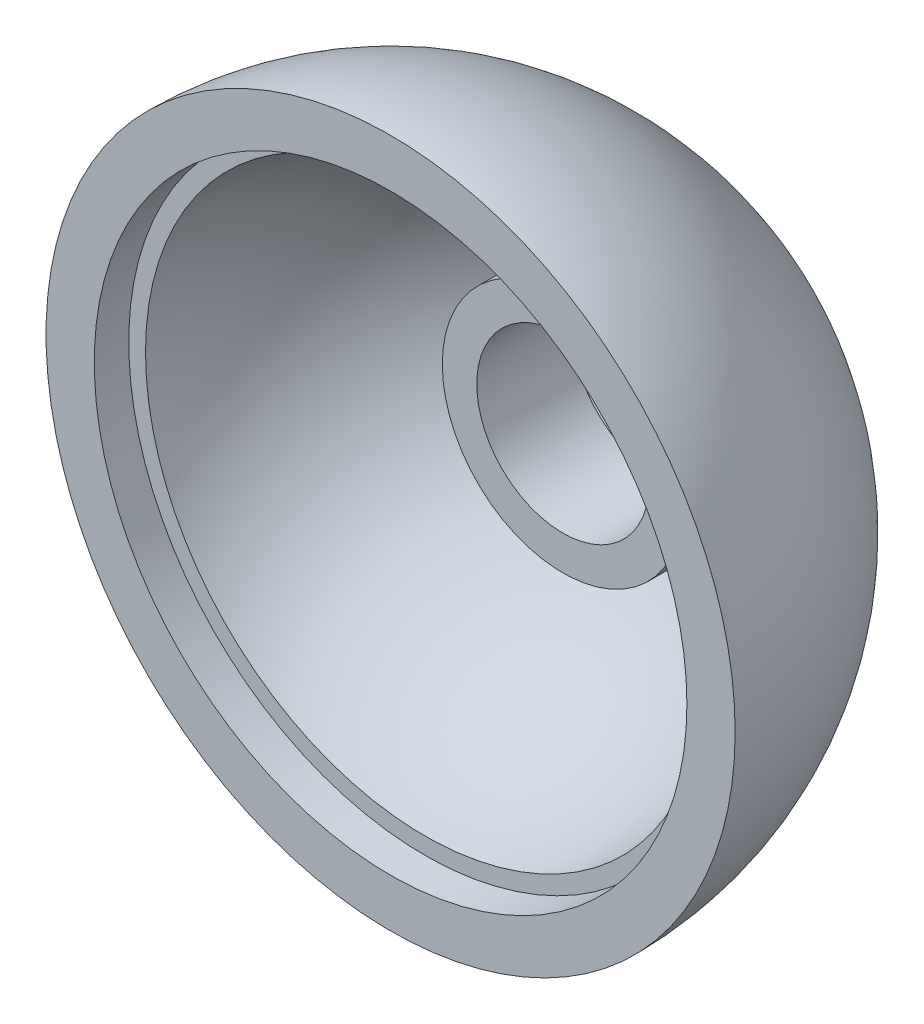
from build123d import *


with BuildPart() as part:
    # Esquisse1 → R_volution3 (revolve)
    with BuildSketch(Plane(origin=(0, 0, 0), x_dir=(1, 0, 0), z_dir=(0, 1, 0)), mode=Mode.PRIVATE) as r_volution3_sk:
        with BuildLine():
            Line((-10, 0), (-8.6, 0))
            Line((-8.6, 0), (-8.6, 1))
            Line((-8.6, 1), (-8.113060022, 1))
            ThreePointArc((-8.113060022, 1), (-6.62684631, 4.786089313), (-3.5, 7.387268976))
            Line((-3.5, 7.387268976), (-3.5, 5))
            Line((-3.5, 5), (-2.5, 5))
            Line((-2.5, 5), (-2.5, 7.782785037))
            ThreePointArc((-2.5, 7.782785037), (-1.265247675, 8.075945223), (0, 8.174456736))
            Line((0, 8.174456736), (0, 10))
            ThreePointArc((0, 10), (-7.071067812, 7.071067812), (-10, 0))
        make_face()
    revolve(r_volution3_sk.sketch.rotate(Axis((0, 0, 0), (0, 0, -1)), 180), axis=Axis((0, 0, 0), (0, 0, -1)))


solid = part.part
